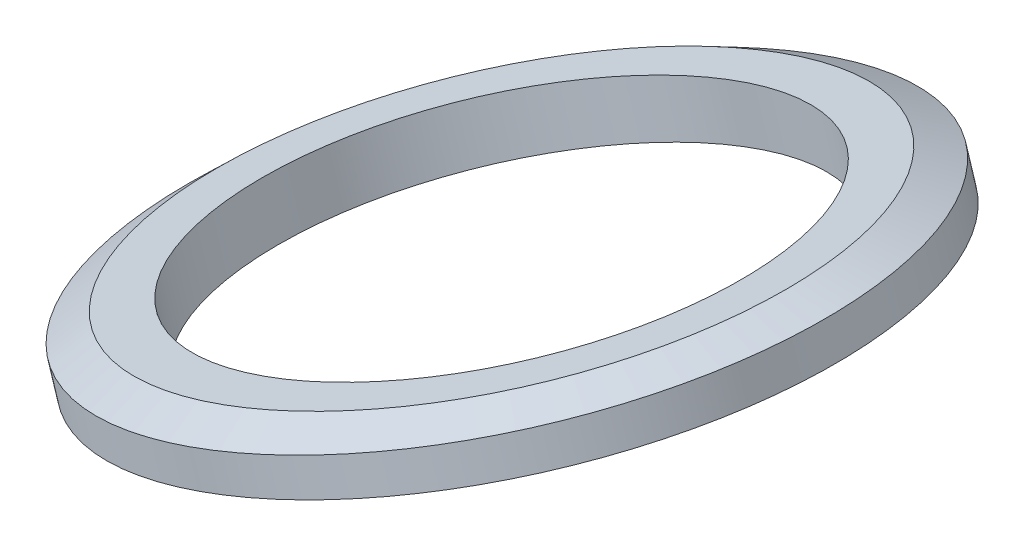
ISO-10303-21;
HEADER;
FILE_DESCRIPTION(('STEP AP214'),'2;1');
FILE_NAME('part.step','',(''),(''),'','','');
FILE_SCHEMA(('AUTOMOTIVE_DESIGN { 1 0 10303 214 1 1 1 1 }'));
ENDSEC;
DATA;
#1=APPLICATION_CONTEXT('core data for automotive mechanical design processes');
#2=APPLICATION_PROTOCOL_DEFINITION('international standard','automotive_design',2000,#1);
#3=PRODUCT_CONTEXT('',#1,'mechanical');
#4=PRODUCT('Part','Part','',(#3));
#5=PRODUCT_RELATED_PRODUCT_CATEGORY('part','',(#4));
#6=PRODUCT_DEFINITION_FORMATION('','',#4);
#7=PRODUCT_DEFINITION_CONTEXT('part definition',#1,'design');
#8=PRODUCT_DEFINITION('design','',#6,#7);
#9=PRODUCT_DEFINITION_SHAPE('','',#8);
#10=(LENGTH_UNIT() NAMED_UNIT(*) SI_UNIT(.MILLI.,.METRE.));
#11=(NAMED_UNIT(*) PLANE_ANGLE_UNIT() SI_UNIT($,.RADIAN.));
#12=(NAMED_UNIT(*) SI_UNIT($,.STERADIAN.) SOLID_ANGLE_UNIT());
#13=UNCERTAINTY_MEASURE_WITH_UNIT(LENGTH_MEASURE(1.E-05),#10,'distance_accuracy_value','');
#14=(GEOMETRIC_REPRESENTATION_CONTEXT(3) GLOBAL_UNCERTAINTY_ASSIGNED_CONTEXT((#13)) GLOBAL_UNIT_ASSIGNED_CONTEXT((#10,
#11,#12)) REPRESENTATION_CONTEXT('',''));
#15=CARTESIAN_POINT('',(0.,0.,0.));
#16=DIRECTION('',(0.,0.,1.));
#17=DIRECTION('',(1.,0.,0.));
#18=AXIS2_PLACEMENT_3D('',#15,#16,#17);
#19=CARTESIAN_POINT('',(406.994285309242,401.009715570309,0.));
#20=DIRECTION('',(-0.300714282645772,0.953714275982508,0.));
#21=DIRECTION('',(-0.953714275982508,-0.300714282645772,0.));
#22=AXIS2_PLACEMENT_3D('',#19,#20,#21);
#23=CYLINDRICAL_SURFACE('',#22,14.3);
#24=CARTESIAN_POINT('',(409.399999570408,393.380001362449,0.));
#25=DIRECTION('',(-0.300714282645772,0.953714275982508,0.));
#26=DIRECTION('',(-0.953714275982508,-0.300714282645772,0.));
#27=AXIS2_PLACEMENT_3D('',#24,#25,#26);
#28=CIRCLE('',#27,14.3000000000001);
#29=CARTESIAN_POINT('',(395.761885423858,389.079787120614,0.));
#30=VERTEX_POINT('',#29);
#31=EDGE_CURVE('E51',#30,#30,#28,.T.);
#32=ORIENTED_EDGE('',*,*,#31,.F.);
#33=EDGE_LOOP('',(#32));
#34=FACE_BOUND('',#33,.T.);
#35=CARTESIAN_POINT('',(408.497856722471,396.241144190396,0.));
#36=DIRECTION('',(-0.300714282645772,0.953714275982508,0.));
#37=DIRECTION('',(-0.953714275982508,-0.300714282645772,0.));
#38=AXIS2_PLACEMENT_3D('',#35,#36,#37);
#39=CIRCLE('',#38,14.3);
#40=CARTESIAN_POINT('',(394.859742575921,391.940929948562,0.));
#41=VERTEX_POINT('',#40);
#42=EDGE_CURVE('E10',#41,#41,#39,.T.);
#43=ORIENTED_EDGE('',*,*,#42,.T.);
#44=EDGE_LOOP('',(#43));
#45=FACE_BOUND('',#44,.T.);
#46=ADVANCED_FACE('F32',(#34,#45),#23,.F.);
#47=CARTESIAN_POINT('',(422.135970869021,400.541358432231,0.));
#48=DIRECTION('',(0.300714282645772,-0.953714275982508,0.));
#49=DIRECTION('',(0.953714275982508,0.300714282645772,0.));
#50=AXIS2_PLACEMENT_3D('',#47,#48,#49);
#51=PLANE('',#50);
#52=ORIENTED_EDGE('',*,*,#42,.F.);
#53=EDGE_LOOP('',(#52));
#54=FACE_BOUND('',#53,.T.);
#55=CARTESIAN_POINT('',(408.497856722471,396.241144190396,0.));
#56=DIRECTION('',(-0.300714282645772,0.953714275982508,0.));
#57=DIRECTION('',(-0.953714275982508,-0.300714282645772,0.));
#58=AXIS2_PLACEMENT_3D('',#55,#56,#57);
#59=CIRCLE('',#58,17.);
#60=CARTESIAN_POINT('',(392.284714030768,391.129001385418,0.));
#61=VERTEX_POINT('',#60);
#62=EDGE_CURVE('E38',#61,#61,#59,.T.);
#63=ORIENTED_EDGE('',*,*,#62,.T.);
#64=EDGE_LOOP('',(#63));
#65=FACE_BOUND('',#64,.T.);
#66=ADVANCED_FACE('F58',(#54,#65),#51,.F.);
#67=CARTESIAN_POINT('',(408.798571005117,395.287429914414,0.));
#68=DIRECTION('',(0.300714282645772,-0.953714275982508,0.));
#69=DIRECTION('',(0.953714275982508,0.300714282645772,0.));
#70=AXIS2_PLACEMENT_3D('',#67,#68,#69);
#71=CONICAL_SURFACE('',#70,19.,1.1071487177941);
#72=ORIENTED_EDGE('',*,*,#62,.F.);
#73=EDGE_LOOP('',(#72));
#74=FACE_BOUND('',#73,.T.);
#75=CARTESIAN_POINT('',(408.798571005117,395.287429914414,0.));
#76=DIRECTION('',(-0.300714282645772,0.953714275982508,0.));
#77=DIRECTION('',(-0.953714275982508,-0.300714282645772,0.));
#78=AXIS2_PLACEMENT_3D('',#75,#76,#77);
#79=CIRCLE('',#78,19.);
#80=CARTESIAN_POINT('',(390.677999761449,389.573858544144,0.));
#81=VERTEX_POINT('',#80);
#82=EDGE_CURVE('E42',#81,#81,#79,.T.);
#83=ORIENTED_EDGE('',*,*,#82,.T.);
#84=EDGE_LOOP('',(#83));
#85=FACE_BOUND('',#84,.T.);
#86=ADVANCED_FACE('F62',(#74,#85),#71,.T.);
#87=CARTESIAN_POINT('',(406.994285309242,401.009715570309,0.));
#88=DIRECTION('',(-0.300714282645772,0.953714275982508,0.));
#89=DIRECTION('',(-0.953714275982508,-0.300714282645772,0.));
#90=AXIS2_PLACEMENT_3D('',#87,#88,#89);
#91=CYLINDRICAL_SURFACE('',#90,19.0000000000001);
#92=ORIENTED_EDGE('',*,*,#82,.F.);
#93=EDGE_LOOP('',(#92));
#94=FACE_BOUND('',#93,.T.);
#95=CARTESIAN_POINT('',(409.399999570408,393.380001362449,0.));
#96=DIRECTION('',(-0.300714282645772,0.953714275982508,0.));
#97=DIRECTION('',(-0.953714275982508,-0.300714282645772,0.));
#98=AXIS2_PLACEMENT_3D('',#95,#96,#97);
#99=CIRCLE('',#98,19.0000000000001);
#100=CARTESIAN_POINT('',(391.27942832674,387.666429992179,0.));
#101=VERTEX_POINT('',#100);
#102=EDGE_CURVE('E46',#101,#101,#99,.T.);
#103=ORIENTED_EDGE('',*,*,#102,.T.);
#104=EDGE_LOOP('',(#103));
#105=FACE_BOUND('',#104,.T.);
#106=ADVANCED_FACE('F67',(#94,#105),#91,.T.);
#107=CARTESIAN_POINT('',(427.520570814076,399.093572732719,0.));
#108=DIRECTION('',(-0.300714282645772,0.953714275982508,0.));
#109=DIRECTION('',(-0.953714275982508,-0.300714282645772,0.));
#110=AXIS2_PLACEMENT_3D('',#107,#108,#109);
#111=PLANE('',#110);
#112=ORIENTED_EDGE('',*,*,#102,.F.);
#113=EDGE_LOOP('',(#112));
#114=FACE_BOUND('',#113,.T.);
#115=ORIENTED_EDGE('',*,*,#31,.T.);
#116=EDGE_LOOP('',(#115));
#117=FACE_BOUND('',#116,.T.);
#118=ADVANCED_FACE('F55',(#114,#117),#111,.F.);
#119=CLOSED_SHELL('',(#46,#66,#86,#106,#118));
#120=MANIFOLD_SOLID_BREP('B2',#119);
#121=ADVANCED_BREP_SHAPE_REPRESENTATION('',(#18,#120),#14);
#122=SHAPE_DEFINITION_REPRESENTATION(#9,#121);
ENDSEC;
END-ISO-10303-21;
